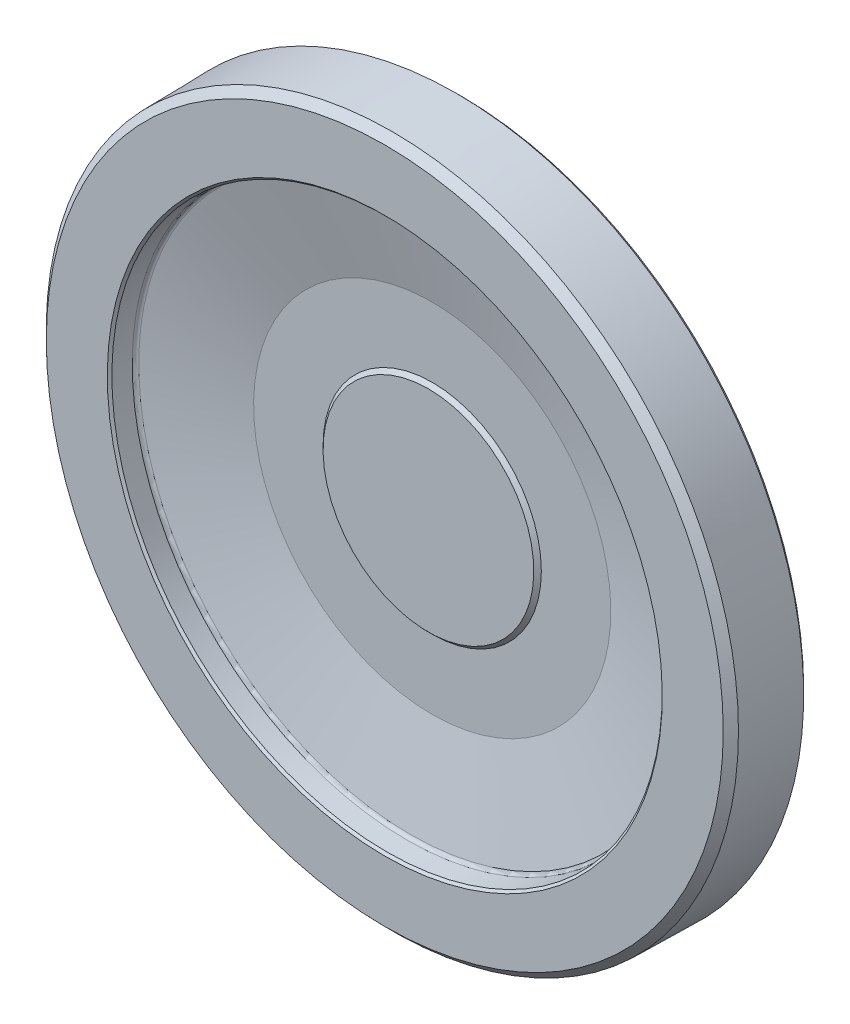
ISO-10303-21;
HEADER;
FILE_DESCRIPTION(('STEP AP214'),'2;1');
FILE_NAME('part.step','',(''),(''),'','','');
FILE_SCHEMA(('AUTOMOTIVE_DESIGN { 1 0 10303 214 1 1 1 1 }'));
ENDSEC;
DATA;
#1=APPLICATION_CONTEXT('core data for automotive mechanical design processes');
#2=APPLICATION_PROTOCOL_DEFINITION('international standard','automotive_design',2000,#1);
#3=PRODUCT_CONTEXT('',#1,'mechanical');
#4=PRODUCT('Part','Part','',(#3));
#5=PRODUCT_RELATED_PRODUCT_CATEGORY('part','',(#4));
#6=PRODUCT_DEFINITION_FORMATION('','',#4);
#7=PRODUCT_DEFINITION_CONTEXT('part definition',#1,'design');
#8=PRODUCT_DEFINITION('design','',#6,#7);
#9=PRODUCT_DEFINITION_SHAPE('','',#8);
#10=(LENGTH_UNIT() NAMED_UNIT(*) SI_UNIT(.MILLI.,.METRE.));
#11=(NAMED_UNIT(*) PLANE_ANGLE_UNIT() SI_UNIT($,.RADIAN.));
#12=(NAMED_UNIT(*) SI_UNIT($,.STERADIAN.) SOLID_ANGLE_UNIT());
#13=UNCERTAINTY_MEASURE_WITH_UNIT(LENGTH_MEASURE(1.E-05),#10,'distance_accuracy_value','');
#14=(GEOMETRIC_REPRESENTATION_CONTEXT(3) GLOBAL_UNCERTAINTY_ASSIGNED_CONTEXT((#13)) GLOBAL_UNIT_ASSIGNED_CONTEXT((#10,
#11,#12)) REPRESENTATION_CONTEXT('',''));
#15=CARTESIAN_POINT('',(0.,0.,0.));
#16=DIRECTION('',(0.,0.,1.));
#17=DIRECTION('',(1.,0.,0.));
#18=AXIS2_PLACEMENT_3D('',#15,#16,#17);
#19=CARTESIAN_POINT('',(0.,0.,43.));
#20=DIRECTION('',(0.,0.,-1.));
#21=DIRECTION('',(0.,1.,0.));
#22=AXIS2_PLACEMENT_3D('',#19,#20,#21);
#23=PLANE('',#22);
#24=CARTESIAN_POINT('',(0.,0.,43.));
#25=DIRECTION('',(0.,0.,-1.));
#26=DIRECTION('',(0.,1.,0.));
#27=AXIS2_PLACEMENT_3D('',#24,#25,#26);
#28=CIRCLE('',#27,26.55);
#29=CARTESIAN_POINT('',(0.,26.55,43.));
#30=VERTEX_POINT('',#29);
#31=EDGE_CURVE('E15',#30,#30,#28,.T.);
#32=ORIENTED_EDGE('',*,*,#31,.F.);
#33=EDGE_LOOP('',(#32));
#34=FACE_BOUND('',#33,.T.);
#35=ADVANCED_FACE('F12',(#34),#23,.F.);
#36=CARTESIAN_POINT('',(0.,0.,42.05));
#37=DIRECTION('',(0.,0.,-1.));
#38=DIRECTION('',(0.,1.,0.));
#39=AXIS2_PLACEMENT_3D('',#36,#37,#38);
#40=CONICAL_SURFACE('',#39,27.5,0.785398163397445);
#41=ORIENTED_EDGE('',*,*,#31,.T.);
#42=EDGE_LOOP('',(#41));
#43=FACE_BOUND('',#42,.T.);
#44=CARTESIAN_POINT('',(0.,0.,42.05));
#45=DIRECTION('',(0.,0.,-1.));
#46=DIRECTION('',(0.,1.,0.));
#47=AXIS2_PLACEMENT_3D('',#44,#45,#46);
#48=CIRCLE('',#47,27.5);
#49=CARTESIAN_POINT('',(0.,27.5,42.05));
#50=VERTEX_POINT('',#49);
#51=EDGE_CURVE('E148',#50,#50,#48,.F.);
#52=ORIENTED_EDGE('',*,*,#51,.T.);
#53=EDGE_LOOP('',(#52));
#54=FACE_BOUND('',#53,.T.);
#55=ADVANCED_FACE('F103',(#43,#54),#40,.T.);
#56=CARTESIAN_POINT('',(27.5,0.,42.05));
#57=DIRECTION('',(0.,0.,-1.));
#58=DIRECTION('',(0.,1.,0.));
#59=AXIS2_PLACEMENT_3D('',#56,#57,#58);
#60=PLANE('',#59);
#61=ORIENTED_EDGE('',*,*,#51,.F.);
#62=EDGE_LOOP('',(#61));
#63=FACE_BOUND('',#62,.T.);
#64=CARTESIAN_POINT('',(0.,0.,42.05));
#65=DIRECTION('',(0.,0.,1.));
#66=DIRECTION('',(0.,-1.,0.));
#67=AXIS2_PLACEMENT_3D('',#64,#65,#66);
#68=CIRCLE('',#67,45.);
#69=CARTESIAN_POINT('',(0.,-45.,42.05));
#70=VERTEX_POINT('',#69);
#71=EDGE_CURVE('E146',#70,#70,#68,.T.);
#72=ORIENTED_EDGE('',*,*,#71,.T.);
#73=EDGE_LOOP('',(#72));
#74=FACE_BOUND('',#73,.T.);
#75=ADVANCED_FACE('F100',(#63,#74),#60,.F.);
#76=CARTESIAN_POINT('',(0.,0.,47.4771503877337));
#77=DIRECTION('',(0.,0.,1.));
#78=DIRECTION('',(0.,-1.,0.));
#79=AXIS2_PLACEMENT_3D('',#76,#77,#78);
#80=CONICAL_SURFACE('',#79,68.5075709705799,1.34390352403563);
#81=ORIENTED_EDGE('',*,*,#71,.F.);
#82=EDGE_LOOP('',(#81));
#83=FACE_BOUND('',#82,.T.);
#84=CARTESIAN_POINT('',(0.,0.,47.4771503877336));
#85=DIRECTION('',(0.,0.,-1.));
#86=DIRECTION('',(0.,1.,0.));
#87=AXIS2_PLACEMENT_3D('',#84,#85,#86);
#88=CIRCLE('',#87,68.5075709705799);
#89=CARTESIAN_POINT('',(0.,68.5075709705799,47.4771503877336));
#90=VERTEX_POINT('',#89);
#91=EDGE_CURVE('E83',#90,#90,#88,.F.);
#92=ORIENTED_EDGE('',*,*,#91,.T.);
#93=EDGE_LOOP('',(#92));
#94=FACE_BOUND('',#93,.T.);
#95=ADVANCED_FACE('F95',(#83,#94),#80,.F.);
#96=CARTESIAN_POINT('',(0.,0.,48.4028019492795));
#97=DIRECTION('',(0.,0.,-1.));
#98=DIRECTION('',(0.,1.,0.));
#99=AXIS2_PLACEMENT_3D('',#96,#97,#98);
#100=TOROIDAL_SURFACE('',#99,68.2938674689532,0.949999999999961);
#101=ORIENTED_EDGE('',*,*,#91,.F.);
#102=EDGE_LOOP('',(#101));
#103=FACE_BOUND('',#102,.T.);
#104=CARTESIAN_POINT('',(0.,0.,48.3862221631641));
#105=DIRECTION('',(0.,0.,1.));
#106=DIRECTION('',(0.,-1.,0.));
#107=AXIS2_PLACEMENT_3D('',#104,#105,#106);
#108=CIRCLE('',#107,69.2437227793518);
#109=CARTESIAN_POINT('',(0.,-69.2437227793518,48.3862221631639));
#110=VERTEX_POINT('',#109);
#111=EDGE_CURVE('E78',#110,#110,#108,.T.);
#112=ORIENTED_EDGE('',*,*,#111,.T.);
#113=EDGE_LOOP('',(#112));
#114=FACE_BOUND('',#113,.T.);
#115=ADVANCED_FACE('F90',(#103,#114),#100,.F.);
#116=CARTESIAN_POINT('',(0.,0.,53.4300868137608));
#117=DIRECTION('',(0.,0.,1.));
#118=DIRECTION('',(0.,-1.,0.));
#119=AXIS2_PLACEMENT_3D('',#116,#117,#118);
#120=CONICAL_SURFACE('',#119,69.3317637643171,0.0174532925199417);
#121=ORIENTED_EDGE('',*,*,#111,.F.);
#122=EDGE_LOOP('',(#121));
#123=FACE_BOUND('',#122,.T.);
#124=CARTESIAN_POINT('',(0.,0.,53.4300868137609));
#125=DIRECTION('',(0.,0.,1.));
#126=DIRECTION('',(0.,-1.,0.));
#127=AXIS2_PLACEMENT_3D('',#124,#125,#126);
#128=CIRCLE('',#127,69.3317637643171);
#129=CARTESIAN_POINT('',(0.,-69.3317637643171,53.4300868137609));
#130=VERTEX_POINT('',#129);
#131=EDGE_CURVE('E74',#130,#130,#128,.T.);
#132=ORIENTED_EDGE('',*,*,#131,.T.);
#133=EDGE_LOOP('',(#132));
#134=FACE_BOUND('',#133,.T.);
#135=ADVANCED_FACE('F94',(#123,#134),#120,.F.);
#136=CARTESIAN_POINT('',(0.,0.,54.));
#137=DIRECTION('',(0.,0.,1.));
#138=DIRECTION('',(0.,-1.,0.));
#139=AXIS2_PLACEMENT_3D('',#136,#137,#138);
#140=CONICAL_SURFACE('',#139,69.9117116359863,0.79412480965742);
#141=ORIENTED_EDGE('',*,*,#131,.F.);
#142=EDGE_LOOP('',(#141));
#143=FACE_BOUND('',#142,.T.);
#144=CARTESIAN_POINT('',(0.,0.,54.));
#145=DIRECTION('',(0.,0.,1.));
#146=DIRECTION('',(0.,-1.,0.));
#147=AXIS2_PLACEMENT_3D('',#144,#145,#146);
#148=CIRCLE('',#147,69.9117116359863);
#149=CARTESIAN_POINT('',(0.,-69.9117116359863,54.));
#150=VERTEX_POINT('',#149);
#151=EDGE_CURVE('E77',#150,#150,#148,.T.);
#152=ORIENTED_EDGE('',*,*,#151,.T.);
#153=EDGE_LOOP('',(#152));
#154=FACE_BOUND('',#153,.T.);
#155=ADVANCED_FACE('F162',(#143,#154),#140,.F.);
#156=CARTESIAN_POINT('',(69.9117116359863,0.,54.));
#157=DIRECTION('',(0.,0.,-1.));
#158=DIRECTION('',(0.,1.,0.));
#159=AXIS2_PLACEMENT_3D('',#156,#157,#158);
#160=PLANE('',#159);
#161=ORIENTED_EDGE('',*,*,#151,.F.);
#162=EDGE_LOOP('',(#161));
#163=FACE_BOUND('',#162,.T.);
#164=CARTESIAN_POINT('',(0.,0.,54.));
#165=DIRECTION('',(0.,0.,-1.));
#166=DIRECTION('',(1.,0.,0.));
#167=AXIS2_PLACEMENT_3D('',#164,#165,#166);
#168=CIRCLE('',#167,85.2849360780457);
#169=CARTESIAN_POINT('',(85.2849360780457,0.,54.));
#170=VERTEX_POINT('',#169);
#171=EDGE_CURVE('E141',#170,#170,#168,.T.);
#172=ORIENTED_EDGE('',*,*,#171,.F.);
#173=EDGE_LOOP('',(#172));
#174=FACE_BOUND('',#173,.T.);
#175=ADVANCED_FACE('F167',(#163,#174),#160,.F.);
#176=CARTESIAN_POINT('',(19.25,0.,0.));
#177=DIRECTION('',(0.,0.,1.));
#178=DIRECTION('',(0.,-1.,0.));
#179=AXIS2_PLACEMENT_3D('',#176,#177,#178);
#180=PLANE('',#179);
#181=CARTESIAN_POINT('',(0.,0.,0.));
#182=DIRECTION('',(0.,0.,1.));
#183=DIRECTION('',(0.,-1.,0.));
#184=AXIS2_PLACEMENT_3D('',#181,#182,#183);
#185=CIRCLE('',#184,19.25);
#186=CARTESIAN_POINT('',(0.,-19.25,0.));
#187=VERTEX_POINT('',#186);
#188=EDGE_CURVE('E71',#187,#187,#185,.T.);
#189=ORIENTED_EDGE('',*,*,#188,.F.);
#190=EDGE_LOOP('',(#189));
#191=FACE_BOUND('',#190,.T.);
#192=ADVANCED_FACE('F172',(#191),#180,.F.);
#193=CARTESIAN_POINT('',(0.,0.,52.1002893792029));
#194=DIRECTION('',(0.,0.,-1.));
#195=DIRECTION('',(1.,0.,0.));
#196=AXIS2_PLACEMENT_3D('',#193,#194,#195);
#197=CONICAL_SURFACE('',#196,87.2180956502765,0.794124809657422);
#198=ORIENTED_EDGE('',*,*,#171,.T.);
#199=EDGE_LOOP('',(#198));
#200=FACE_BOUND('',#199,.T.);
#201=CARTESIAN_POINT('',(0.,0.,52.1002893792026));
#202=DIRECTION('',(0.,0.,-1.));
#203=DIRECTION('',(0.,1.,0.));
#204=AXIS2_PLACEMENT_3D('',#201,#202,#203);
#205=CIRCLE('',#204,87.2180956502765);
#206=CARTESIAN_POINT('',(0.,87.2180956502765,52.1002893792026));
#207=VERTEX_POINT('',#206);
#208=EDGE_CURVE('E66',#207,#207,#205,.T.);
#209=ORIENTED_EDGE('',*,*,#208,.F.);
#210=EDGE_LOOP('',(#209));
#211=FACE_BOUND('',#210,.T.);
#212=ADVANCED_FACE('F176',(#200,#211),#197,.T.);
#213=CARTESIAN_POINT('',(0.,0.,0.75));
#214=DIRECTION('',(0.,0.,1.));
#215=DIRECTION('',(0.,-1.,0.));
#216=AXIS2_PLACEMENT_3D('',#213,#214,#215);
#217=CONICAL_SURFACE('',#216,20.,0.785398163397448);
#218=CARTESIAN_POINT('',(0.,0.,0.75));
#219=DIRECTION('',(0.,0.,1.));
#220=DIRECTION('',(0.,-1.,0.));
#221=AXIS2_PLACEMENT_3D('',#218,#219,#220);
#222=CIRCLE('',#221,20.);
#223=CARTESIAN_POINT('',(0.,-20.,0.75));
#224=VERTEX_POINT('',#223);
#225=EDGE_CURVE('E61',#224,#224,#222,.T.);
#226=ORIENTED_EDGE('',*,*,#225,.F.);
#227=EDGE_LOOP('',(#226));
#228=FACE_BOUND('',#227,.T.);
#229=ORIENTED_EDGE('',*,*,#188,.T.);
#230=EDGE_LOOP('',(#229));
#231=FACE_BOUND('',#230,.T.);
#232=ADVANCED_FACE('F179',(#228,#231),#217,.T.);
#233=CARTESIAN_POINT('',(0.,0.,35.9498553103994));
#234=DIRECTION('',(0.,0.,-1.));
#235=DIRECTION('',(0.,1.,0.));
#236=AXIS2_PLACEMENT_3D('',#233,#234,#235);
#237=CONICAL_SURFACE('',#236,87.5000025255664,0.0174532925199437);
#238=ORIENTED_EDGE('',*,*,#208,.T.);
#239=EDGE_LOOP('',(#238));
#240=FACE_BOUND('',#239,.T.);
#241=CARTESIAN_POINT('',(0.,0.,35.9498553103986));
#242=DIRECTION('',(0.,0.,1.));
#243=DIRECTION('',(0.,-1.,0.));
#244=AXIS2_PLACEMENT_3D('',#241,#242,#243);
#245=CIRCLE('',#244,87.5000025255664);
#246=CARTESIAN_POINT('',(0.,-87.5000025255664,35.9498553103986));
#247=VERTEX_POINT('',#246);
#248=EDGE_CURVE('E57',#247,#247,#245,.F.);
#249=ORIENTED_EDGE('',*,*,#248,.F.);
#250=EDGE_LOOP('',(#249));
#251=FACE_BOUND('',#250,.T.);
#252=ADVANCED_FACE('F183',(#240,#251),#237,.T.);
#253=CARTESIAN_POINT('',(0.,0.,0.));
#254=DIRECTION('',(0.,0.,1.));
#255=DIRECTION('',(0.,-1.,0.));
#256=AXIS2_PLACEMENT_3D('',#253,#254,#255);
#257=CYLINDRICAL_SURFACE('',#256,20.);
#258=CARTESIAN_POINT('',(0.,0.,15.));
#259=DIRECTION('',(0.,0.,1.));
#260=DIRECTION('',(0.,-1.,0.));
#261=AXIS2_PLACEMENT_3D('',#258,#259,#260);
#262=CIRCLE('',#261,20.);
#263=CARTESIAN_POINT('',(0.,-20.,15.));
#264=VERTEX_POINT('',#263);
#265=EDGE_CURVE('E60',#264,#264,#262,.F.);
#266=ORIENTED_EDGE('',*,*,#265,.T.);
#267=EDGE_LOOP('',(#266));
#268=FACE_BOUND('',#267,.T.);
#269=ORIENTED_EDGE('',*,*,#225,.T.);
#270=EDGE_LOOP('',(#269));
#271=FACE_BOUND('',#270,.T.);
#272=ADVANCED_FACE('F186',(#268,#271),#257,.T.);
#273=CARTESIAN_POINT('',(0.,0.,35.9498553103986));
#274=DIRECTION('',(0.,0.,1.));
#275=DIRECTION('',(0.,-1.,0.));
#276=AXIS2_PLACEMENT_3D('',#273,#274,#275);
#277=CONICAL_SURFACE('',#276,87.5000025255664,0.776671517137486);
#278=ORIENTED_EDGE('',*,*,#248,.T.);
#279=EDGE_LOOP('',(#278));
#280=FACE_BOUND('',#279,.T.);
#281=CARTESIAN_POINT('',(0.,0.,35.));
#282=DIRECTION('',(0.,0.,1.));
#283=DIRECTION('',(0.,-1.,0.));
#284=AXIS2_PLACEMENT_3D('',#281,#282,#283);
#285=CIRCLE('',#284,86.5665823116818);
#286=CARTESIAN_POINT('',(0.,-86.5665823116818,35.));
#287=VERTEX_POINT('',#286);
#288=EDGE_CURVE('E130',#287,#287,#285,.T.);
#289=ORIENTED_EDGE('',*,*,#288,.T.);
#290=EDGE_LOOP('',(#289));
#291=FACE_BOUND('',#290,.T.);
#292=ADVANCED_FACE('F190',(#280,#291),#277,.T.);
#293=CARTESIAN_POINT('',(28.,0.,15.));
#294=DIRECTION('',(0.,0.,1.));
#295=DIRECTION('',(0.,-1.,0.));
#296=AXIS2_PLACEMENT_3D('',#293,#294,#295);
#297=PLANE('',#296);
#298=CARTESIAN_POINT('',(0.,0.,15.));
#299=DIRECTION('',(0.,0.,1.));
#300=DIRECTION('',(0.,-1.,0.));
#301=AXIS2_PLACEMENT_3D('',#298,#299,#300);
#302=CIRCLE('',#301,28.);
#303=CARTESIAN_POINT('',(0.,-28.,15.));
#304=VERTEX_POINT('',#303);
#305=EDGE_CURVE('E128',#304,#304,#302,.T.);
#306=ORIENTED_EDGE('',*,*,#305,.F.);
#307=EDGE_LOOP('',(#306));
#308=FACE_BOUND('',#307,.T.);
#309=ORIENTED_EDGE('',*,*,#265,.F.);
#310=EDGE_LOOP('',(#309));
#311=FACE_BOUND('',#310,.T.);
#312=ADVANCED_FACE('F193',(#308,#311),#297,.F.);
#313=CARTESIAN_POINT('',(86.5665823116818,0.,35.));
#314=DIRECTION('',(0.,0.,1.));
#315=DIRECTION('',(0.,-1.,0.));
#316=AXIS2_PLACEMENT_3D('',#313,#314,#315);
#317=PLANE('',#316);
#318=ORIENTED_EDGE('',*,*,#288,.F.);
#319=EDGE_LOOP('',(#318));
#320=FACE_BOUND('',#319,.T.);
#321=CARTESIAN_POINT('',(0.,0.,35.));
#322=DIRECTION('',(0.,0.,1.));
#323=DIRECTION('',(0.,-1.,0.));
#324=AXIS2_PLACEMENT_3D('',#321,#322,#323);
#325=CIRCLE('',#324,69.2307692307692);
#326=CARTESIAN_POINT('',(0.,-69.2307692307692,35.));
#327=VERTEX_POINT('',#326);
#328=EDGE_CURVE('E54',#327,#327,#325,.T.);
#329=ORIENTED_EDGE('',*,*,#328,.T.);
#330=EDGE_LOOP('',(#329));
#331=FACE_BOUND('',#330,.T.);
#332=ADVANCED_FACE('F125',(#320,#331),#317,.F.);
#333=CARTESIAN_POINT('',(0.,0.,0.));
#334=DIRECTION('',(0.,0.,1.));
#335=DIRECTION('',(0.,-1.,0.));
#336=AXIS2_PLACEMENT_3D('',#333,#334,#335);
#337=CYLINDRICAL_SURFACE('',#336,28.);
#338=CARTESIAN_POINT('',(0.,0.,23.1628329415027));
#339=DIRECTION('',(0.,0.,-1.));
#340=DIRECTION('',(0.,1.,0.));
#341=AXIS2_PLACEMENT_3D('',#338,#339,#340);
#342=CIRCLE('',#341,28.);
#343=CARTESIAN_POINT('',(0.,28.,23.1628329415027));
#344=VERTEX_POINT('',#343);
#345=EDGE_CURVE('E51',#344,#344,#342,.T.);
#346=ORIENTED_EDGE('',*,*,#345,.T.);
#347=EDGE_LOOP('',(#346));
#348=FACE_BOUND('',#347,.T.);
#349=ORIENTED_EDGE('',*,*,#305,.T.);
#350=EDGE_LOOP('',(#349));
#351=FACE_BOUND('',#350,.T.);
#352=ADVANCED_FACE('F122',(#348,#351),#337,.T.);
#353=CARTESIAN_POINT('',(0.,0.,0.));
#354=DIRECTION('',(0.,0.,1.));
#355=DIRECTION('',(0.,-1.,0.));
#356=AXIS2_PLACEMENT_3D('',#353,#354,#355);
#357=CYLINDRICAL_SURFACE('',#356,69.2307692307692);
#358=ORIENTED_EDGE('',*,*,#328,.F.);
#359=EDGE_LOOP('',(#358));
#360=FACE_BOUND('',#359,.T.);
#361=CARTESIAN_POINT('',(0.,0.,38.143259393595));
#362=DIRECTION('',(0.,0.,-1.));
#363=DIRECTION('',(0.,1.,0.));
#364=AXIS2_PLACEMENT_3D('',#361,#362,#363);
#365=CIRCLE('',#364,69.2307692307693);
#366=CARTESIAN_POINT('',(0.,69.2307692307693,38.143259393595));
#367=VERTEX_POINT('',#366);
#368=EDGE_CURVE('E24',#367,#367,#365,.F.);
#369=ORIENTED_EDGE('',*,*,#368,.T.);
#370=EDGE_LOOP('',(#369));
#371=FACE_BOUND('',#370,.T.);
#372=ADVANCED_FACE('F45',(#360,#371),#357,.F.);
#373=CARTESIAN_POINT('',(0.,0.,23.1628329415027));
#374=DIRECTION('',(0.,0.,-1.));
#375=DIRECTION('',(0.,1.,0.));
#376=AXIS2_PLACEMENT_3D('',#373,#374,#375);
#377=TOROIDAL_SURFACE('',#376,29.9,1.9);
#378=CARTESIAN_POINT('',(0.,0.,24.9482489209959));
#379=DIRECTION('',(0.,0.,1.));
#380=DIRECTION('',(0.,-1.,0.));
#381=AXIS2_PLACEMENT_3D('',#378,#379,#380);
#382=CIRCLE('',#381,29.2501617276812);
#383=CARTESIAN_POINT('',(0.,-29.2501617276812,24.9482489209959));
#384=VERTEX_POINT('',#383);
#385=EDGE_CURVE('E19',#384,#384,#382,.T.);
#386=ORIENTED_EDGE('',*,*,#385,.F.);
#387=EDGE_LOOP('',(#386));
#388=FACE_BOUND('',#387,.T.);
#389=ORIENTED_EDGE('',*,*,#345,.F.);
#390=EDGE_LOOP('',(#389));
#391=FACE_BOUND('',#390,.T.);
#392=ADVANCED_FACE('F40',(#388,#391),#377,.F.);
#393=CARTESIAN_POINT('',(0.,0.,38.143259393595));
#394=DIRECTION('',(0.,0.,-1.));
#395=DIRECTION('',(0.,1.,0.));
#396=AXIS2_PLACEMENT_3D('',#393,#394,#395);
#397=TOROIDAL_SURFACE('',#396,68.2807692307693,0.949999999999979);
#398=ORIENTED_EDGE('',*,*,#368,.F.);
#399=EDGE_LOOP('',(#398));
#400=FACE_BOUND('',#399,.T.);
#401=CARTESIAN_POINT('',(0.,0.,39.0359673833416));
#402=DIRECTION('',(0.,0.,1.));
#403=DIRECTION('',(0.,-1.,0.));
#404=AXIS2_PLACEMENT_3D('',#401,#402,#403);
#405=CIRCLE('',#404,67.9558500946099);
#406=CARTESIAN_POINT('',(0.,-67.9558500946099,39.0359673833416));
#407=VERTEX_POINT('',#406);
#408=EDGE_CURVE('E8',#407,#407,#405,.F.);
#409=ORIENTED_EDGE('',*,*,#408,.F.);
#410=EDGE_LOOP('',(#409));
#411=FACE_BOUND('',#410,.T.);
#412=ADVANCED_FACE('F35',(#400,#411),#397,.F.);
#413=CARTESIAN_POINT('',(0.,0.,39.0359673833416));
#414=DIRECTION('',(0.,0.,1.));
#415=DIRECTION('',(0.,-1.,0.));
#416=AXIS2_PLACEMENT_3D('',#413,#414,#415);
#417=CONICAL_SURFACE('',#416,67.9558500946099,1.22173047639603);
#418=ORIENTED_EDGE('',*,*,#408,.T.);
#419=EDGE_LOOP('',(#418));
#420=FACE_BOUND('',#419,.T.);
#421=ORIENTED_EDGE('',*,*,#385,.T.);
#422=EDGE_LOOP('',(#421));
#423=FACE_BOUND('',#422,.T.);
#424=ADVANCED_FACE('F39',(#420,#423),#417,.T.);
#425=CLOSED_SHELL('',(#35,#55,#75,#95,#115,#135,#155,#175,#192,#212,#232,#252,#272,#292,#312,
#332,#352,#372,#392,#412,#424));
#426=MANIFOLD_SOLID_BREP('B1',#425);
#427=ADVANCED_BREP_SHAPE_REPRESENTATION('',(#18,#426),#14);
#428=SHAPE_DEFINITION_REPRESENTATION(#9,#427);
ENDSEC;
END-ISO-10303-21;
